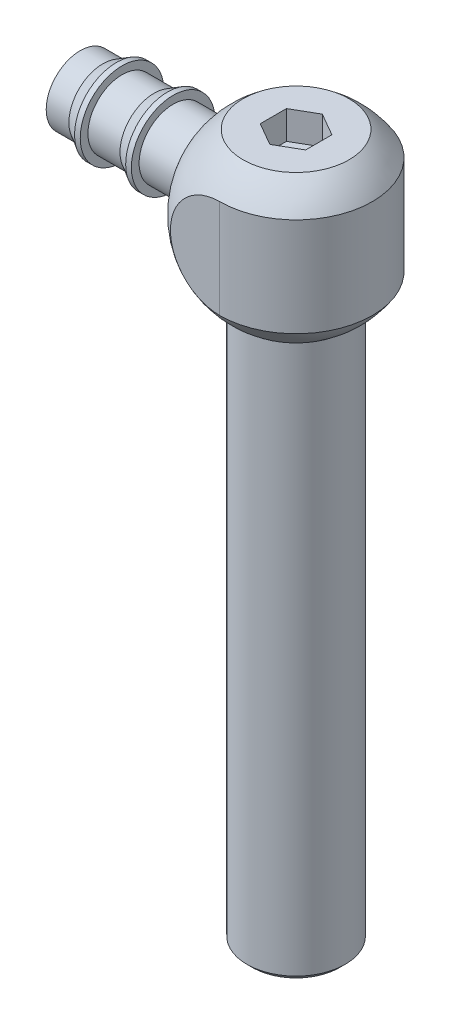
ISO-10303-21;
HEADER;
FILE_DESCRIPTION(('STEP AP214'),'2;1');
FILE_NAME('part.step','',(''),(''),'','','');
FILE_SCHEMA(('AUTOMOTIVE_DESIGN { 1 0 10303 214 1 1 1 1 }'));
ENDSEC;
DATA;
#1=APPLICATION_CONTEXT('core data for automotive mechanical design processes');
#2=APPLICATION_PROTOCOL_DEFINITION('international standard','automotive_design',2000,#1);
#3=PRODUCT_CONTEXT('',#1,'mechanical');
#4=PRODUCT('Part','Part','',(#3));
#5=PRODUCT_RELATED_PRODUCT_CATEGORY('part','',(#4));
#6=PRODUCT_DEFINITION_FORMATION('','',#4);
#7=PRODUCT_DEFINITION_CONTEXT('part definition',#1,'design');
#8=PRODUCT_DEFINITION('design','',#6,#7);
#9=PRODUCT_DEFINITION_SHAPE('','',#8);
#10=(LENGTH_UNIT() NAMED_UNIT(*) SI_UNIT(.MILLI.,.METRE.));
#11=(NAMED_UNIT(*) PLANE_ANGLE_UNIT() SI_UNIT($,.RADIAN.));
#12=(NAMED_UNIT(*) SI_UNIT($,.STERADIAN.) SOLID_ANGLE_UNIT());
#13=UNCERTAINTY_MEASURE_WITH_UNIT(LENGTH_MEASURE(1.E-05),#10,'distance_accuracy_value','');
#14=(GEOMETRIC_REPRESENTATION_CONTEXT(3) GLOBAL_UNCERTAINTY_ASSIGNED_CONTEXT((#13)) GLOBAL_UNIT_ASSIGNED_CONTEXT((#10,
#11,#12)) REPRESENTATION_CONTEXT('',''));
#15=CARTESIAN_POINT('',(0.,0.,0.));
#16=DIRECTION('',(0.,0.,1.));
#17=DIRECTION('',(1.,0.,0.));
#18=AXIS2_PLACEMENT_3D('',#15,#16,#17);
#19=CARTESIAN_POINT('',(-19.05,5.6642,-10.668));
#20=DIRECTION('',(0.,-1.,0.));
#21=DIRECTION('',(1.,0.,0.));
#22=AXIS2_PLACEMENT_3D('',#19,#20,#21);
#23=PLANE('',#22);
#24=CARTESIAN_POINT('',(0.,5.6642,0.));
#25=DIRECTION('',(0.,-1.,0.));
#26=DIRECTION('',(1.,0.,0.));
#27=AXIS2_PLACEMENT_3D('',#24,#25,#26);
#28=CIRCLE('',#27,7.40360712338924);
#29=CARTESIAN_POINT('',(7.40360712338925,5.6642,0.));
#30=VERTEX_POINT('',#29);
#31=EDGE_CURVE('E206',#30,#30,#28,.F.);
#32=ORIENTED_EDGE('',*,*,#31,.F.);
#33=EDGE_LOOP('',(#32));
#34=FACE_BOUND('',#33,.T.);
#35=CARTESIAN_POINT('',(0.,5.6642,0.));
#36=DIRECTION('',(0.,1.,0.));
#37=DIRECTION('',(-1.,0.,0.));
#38=AXIS2_PLACEMENT_3D('',#35,#36,#37);
#39=CIRCLE('',#38,6.85799999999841);
#40=CARTESIAN_POINT('',(-6.85799999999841,5.6642,0.));
#41=VERTEX_POINT('',#40);
#42=EDGE_CURVE('E160',#41,#41,#39,.T.);
#43=ORIENTED_EDGE('',*,*,#42,.T.);
#44=EDGE_LOOP('',(#43));
#45=FACE_BOUND('',#44,.T.);
#46=ADVANCED_FACE('F38',(#34,#45),#23,.T.);
#47=CARTESIAN_POINT('',(-10.668,3.28295,10.668));
#48=DIRECTION('',(1.,0.,0.));
#49=DIRECTION('',(0.,0.,-1.));
#50=AXIS2_PLACEMENT_3D('',#47,#48,#49);
#51=PLANE('',#50);
#52=CARTESIAN_POINT('',(-10.668,15.98295,0.));
#53=DIRECTION('',(1.,0.,0.));
#54=DIRECTION('',(0.,0.,-1.));
#55=AXIS2_PLACEMENT_3D('',#52,#53,#54);
#56=CIRCLE('',#55,5.953125);
#57=CARTESIAN_POINT('',(-10.668,15.98295,-5.953125));
#58=VERTEX_POINT('',#57);
#59=EDGE_CURVE('E12',#58,#58,#56,.T.);
#60=ORIENTED_EDGE('',*,*,#59,.T.);
#61=EDGE_LOOP('',(#60));
#62=FACE_BOUND('',#61,.T.);
#63=CARTESIAN_POINT('',(-10.668,15.98295,0.));
#64=DIRECTION('',(1.,0.,0.));
#65=DIRECTION('',(0.,0.,-1.));
#66=AXIS2_PLACEMENT_3D('',#63,#64,#65);
#67=CIRCLE('',#66,6.89084726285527);
#68=CARTESIAN_POINT('',(-10.668,15.98295,-6.89084726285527));
#69=VERTEX_POINT('',#68);
#70=EDGE_CURVE('E214',#69,#69,#67,.F.);
#71=ORIENTED_EDGE('',*,*,#70,.T.);
#72=EDGE_LOOP('',(#71));
#73=FACE_BOUND('',#72,.T.);
#74=ADVANCED_FACE('F250',(#62,#73),#51,.F.);
#75=CARTESIAN_POINT('',(0.,15.98295,0.));
#76=DIRECTION('',(0.,-1.,0.));
#77=DIRECTION('',(1.,0.,0.));
#78=AXIS2_PLACEMENT_3D('',#75,#76,#77);
#79=SPHERICAL_SURFACE('',#78,12.7);
#80=ORIENTED_EDGE('',*,*,#31,.T.);
#81=EDGE_LOOP('',(#80));
#82=FACE_BOUND('',#81,.T.);
#83=ORIENTED_EDGE('',*,*,#70,.F.);
#84=EDGE_LOOP('',(#83));
#85=FACE_BOUND('',#84,.T.);
#86=CARTESIAN_POINT('',(0.,15.98295,-10.668));
#87=DIRECTION('',(0.,0.,1.));
#88=DIRECTION('',(1.,0.,0.));
#89=AXIS2_PLACEMENT_3D('',#86,#87,#88);
#90=CIRCLE('',#89,6.89084726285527);
#91=CARTESIAN_POINT('',(0.,9.09210273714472,-10.668));
#92=VERTEX_POINT('',#91);
#93=CARTESIAN_POINT('',(0.,22.8737972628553,-10.668));
#94=VERTEX_POINT('',#93);
#95=EDGE_CURVE('E222',#92,#94,#90,.F.);
#96=ORIENTED_EDGE('',*,*,#95,.F.);
#97=CARTESIAN_POINT('',(0.,9.09210273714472,0.));
#98=DIRECTION('',(0.,1.,0.));
#99=DIRECTION('',(0.,0.,1.));
#100=AXIS2_PLACEMENT_3D('',#97,#98,#99);
#101=CIRCLE('',#100,10.668);
#102=CARTESIAN_POINT('',(0.,9.09210273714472,10.668));
#103=VERTEX_POINT('',#102);
#104=EDGE_CURVE('E220',#103,#92,#101,.T.);
#105=ORIENTED_EDGE('',*,*,#104,.F.);
#106=CARTESIAN_POINT('',(0.,15.98295,10.668));
#107=DIRECTION('',(0.,0.,-1.));
#108=DIRECTION('',(-1.,0.,0.));
#109=AXIS2_PLACEMENT_3D('',#106,#107,#108);
#110=CIRCLE('',#109,6.89084726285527);
#111=CARTESIAN_POINT('',(0.,22.8737972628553,10.668));
#112=VERTEX_POINT('',#111);
#113=EDGE_CURVE('E215',#112,#103,#110,.F.);
#114=ORIENTED_EDGE('',*,*,#113,.F.);
#115=CARTESIAN_POINT('',(0.,22.8737972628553,0.));
#116=DIRECTION('',(0.,-1.,0.));
#117=DIRECTION('',(0.,0.,-1.));
#118=AXIS2_PLACEMENT_3D('',#115,#116,#117);
#119=CIRCLE('',#118,10.668);
#120=EDGE_CURVE('E217',#94,#112,#119,.T.);
#121=ORIENTED_EDGE('',*,*,#120,.F.);
#122=EDGE_LOOP('',(#96,#105,#114,#121));
#123=FACE_BOUND('',#122,.T.);
#124=CARTESIAN_POINT('',(0.,26.3017,0.));
#125=DIRECTION('',(0.,1.,0.));
#126=DIRECTION('',(-1.,0.,0.));
#127=AXIS2_PLACEMENT_3D('',#124,#125,#126);
#128=CIRCLE('',#127,7.40360712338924);
#129=CARTESIAN_POINT('',(-7.40360712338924,26.3017,0.));
#130=VERTEX_POINT('',#129);
#131=EDGE_CURVE('E211',#130,#130,#128,.F.);
#132=ORIENTED_EDGE('',*,*,#131,.T.);
#133=EDGE_LOOP('',(#132));
#134=FACE_BOUND('',#133,.T.);
#135=ADVANCED_FACE('F256',(#82,#85,#123,#134),#79,.T.);
#136=CARTESIAN_POINT('',(0.,3.28295,-10.668));
#137=DIRECTION('',(0.,0.,1.));
#138=DIRECTION('',(1.,0.,0.));
#139=AXIS2_PLACEMENT_3D('',#136,#137,#138);
#140=PLANE('',#139);
#141=ORIENTED_EDGE('',*,*,#95,.T.);
#142=DIRECTION('',(0.,-1.,0.));
#143=VECTOR('',#142,1.);
#144=CARTESIAN_POINT('',(0.,3.28295,-10.668));
#145=LINE('',#144,#143);
#146=EDGE_CURVE('E210',#94,#92,#145,.T.);
#147=ORIENTED_EDGE('',*,*,#146,.T.);
#148=EDGE_LOOP('',(#141,#147));
#149=FACE_BOUND('',#148,.T.);
#150=ADVANCED_FACE('F268',(#149),#140,.F.);
#151=CARTESIAN_POINT('',(0.,3.28295,10.668));
#152=DIRECTION('',(0.,0.,-1.));
#153=DIRECTION('',(-1.,0.,0.));
#154=AXIS2_PLACEMENT_3D('',#151,#152,#153);
#155=PLANE('',#154);
#156=ORIENTED_EDGE('',*,*,#113,.T.);
#157=DIRECTION('',(0.,-1.,0.));
#158=VECTOR('',#157,1.);
#159=CARTESIAN_POINT('',(0.,3.28295,10.668));
#160=LINE('',#159,#158);
#161=EDGE_CURVE('E207',#112,#103,#160,.T.);
#162=ORIENTED_EDGE('',*,*,#161,.F.);
#163=EDGE_LOOP('',(#156,#162));
#164=FACE_BOUND('',#163,.T.);
#165=ADVANCED_FACE('F265',(#164),#155,.F.);
#166=CARTESIAN_POINT('',(0.,3.28295,0.));
#167=DIRECTION('',(0.,-1.,0.));
#168=DIRECTION('',(0.,0.,-1.));
#169=AXIS2_PLACEMENT_3D('',#166,#167,#168);
#170=CYLINDRICAL_SURFACE('',#169,10.668);
#171=ORIENTED_EDGE('',*,*,#104,.T.);
#172=ORIENTED_EDGE('',*,*,#146,.F.);
#173=ORIENTED_EDGE('',*,*,#120,.T.);
#174=ORIENTED_EDGE('',*,*,#161,.T.);
#175=EDGE_LOOP('',(#171,#172,#173,#174));
#176=FACE_BOUND('',#175,.T.);
#177=ADVANCED_FACE('F267',(#176),#170,.T.);
#178=CARTESIAN_POINT('',(-19.05,26.3017,-10.668));
#179=DIRECTION('',(0.,1.,0.));
#180=DIRECTION('',(-1.,0.,0.));
#181=AXIS2_PLACEMENT_3D('',#178,#179,#180);
#182=PLANE('',#181);
#183=DIRECTION('',(0.,0.,-1.));
#184=VECTOR('',#183,1.);
#185=CARTESIAN_POINT('',(3.175,26.3017,1.83308710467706));
#186=LINE('',#185,#184);
#187=CARTESIAN_POINT('',(3.175,26.3017,1.83308710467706));
#188=VERTEX_POINT('',#187);
#189=CARTESIAN_POINT('',(3.175,26.3017,-1.83308710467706));
#190=VERTEX_POINT('',#189);
#191=EDGE_CURVE('E59',#188,#190,#186,.T.);
#192=ORIENTED_EDGE('',*,*,#191,.F.);
#193=DIRECTION('',(0.866025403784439,0.,-0.5));
#194=VECTOR('',#193,1.);
#195=CARTESIAN_POINT('',(0.,26.3017,3.66617420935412));
#196=LINE('',#195,#194);
#197=CARTESIAN_POINT('',(0.,26.3017,3.66617420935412));
#198=VERTEX_POINT('',#197);
#199=EDGE_CURVE('E127',#198,#188,#196,.T.);
#200=ORIENTED_EDGE('',*,*,#199,.F.);
#201=DIRECTION('',(0.866025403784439,0.,0.5));
#202=VECTOR('',#201,1.);
#203=CARTESIAN_POINT('',(-3.17499999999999,26.3017,1.83308710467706));
#204=LINE('',#203,#202);
#205=CARTESIAN_POINT('',(-3.17499999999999,26.3017,1.83308710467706));
#206=VERTEX_POINT('',#205);
#207=EDGE_CURVE('E130',#206,#198,#204,.T.);
#208=ORIENTED_EDGE('',*,*,#207,.F.);
#209=DIRECTION('',(0.,0.,1.));
#210=VECTOR('',#209,1.);
#211=CARTESIAN_POINT('',(-3.17499999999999,26.3017,-1.83308710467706));
#212=LINE('',#211,#210);
#213=CARTESIAN_POINT('',(-3.17499999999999,26.3017,-1.83308710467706));
#214=VERTEX_POINT('',#213);
#215=EDGE_CURVE('E153',#214,#206,#212,.T.);
#216=ORIENTED_EDGE('',*,*,#215,.F.);
#217=DIRECTION('',(-0.866025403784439,0.,0.5));
#218=VECTOR('',#217,1.);
#219=CARTESIAN_POINT('',(0.,26.3017,-3.66617420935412));
#220=LINE('',#219,#218);
#221=CARTESIAN_POINT('',(0.,26.3017,-3.66617420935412));
#222=VERTEX_POINT('',#221);
#223=EDGE_CURVE('E150',#222,#214,#220,.T.);
#224=ORIENTED_EDGE('',*,*,#223,.F.);
#225=DIRECTION('',(-0.866025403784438,0.,-0.5));
#226=VECTOR('',#225,1.);
#227=CARTESIAN_POINT('',(3.175,26.3017,-1.83308710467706));
#228=LINE('',#227,#226);
#229=EDGE_CURVE('E148',#190,#222,#228,.T.);
#230=ORIENTED_EDGE('',*,*,#229,.F.);
#231=EDGE_LOOP('',(#192,#200,#208,#216,#224,#230));
#232=FACE_BOUND('',#231,.T.);
#233=ORIENTED_EDGE('',*,*,#131,.F.);
#234=EDGE_LOOP('',(#233));
#235=FACE_BOUND('',#234,.T.);
#236=ADVANCED_FACE('F263',(#232,#235),#182,.T.);
#237=CARTESIAN_POINT('',(0.,15.98295,0.));
#238=DIRECTION('',(-1.,0.,0.));
#239=DIRECTION('',(0.,0.,1.));
#240=AXIS2_PLACEMENT_3D('',#237,#238,#239);
#241=CYLINDRICAL_SURFACE('',#240,4.7625);
#242=CARTESIAN_POINT('',(-11.858625,15.98295,0.));
#243=DIRECTION('',(1.,0.,0.));
#244=DIRECTION('',(0.,0.,-1.));
#245=AXIS2_PLACEMENT_3D('',#242,#243,#244);
#246=CIRCLE('',#245,4.7625);
#247=CARTESIAN_POINT('',(-11.858625,15.98295,-4.7625));
#248=VERTEX_POINT('',#247);
#249=EDGE_CURVE('E46',#248,#248,#246,.F.);
#250=ORIENTED_EDGE('',*,*,#249,.T.);
#251=EDGE_LOOP('',(#250));
#252=FACE_BOUND('',#251,.T.);
#253=CARTESIAN_POINT('',(-17.1802511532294,15.98295,0.));
#254=DIRECTION('',(-1.,0.,0.));
#255=DIRECTION('',(0.,0.,1.));
#256=AXIS2_PLACEMENT_3D('',#253,#254,#255);
#257=CIRCLE('',#256,4.7625);
#258=CARTESIAN_POINT('',(-17.1802511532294,15.98295,4.7625));
#259=VERTEX_POINT('',#258);
#260=EDGE_CURVE('E182',#259,#259,#257,.T.);
#261=ORIENTED_EDGE('',*,*,#260,.F.);
#262=EDGE_LOOP('',(#261));
#263=FACE_BOUND('',#262,.T.);
#264=ADVANCED_FACE('F232',(#252,#263),#241,.T.);
#265=CARTESIAN_POINT('',(0.,15.98295,0.));
#266=DIRECTION('',(-1.,0.,0.));
#267=DIRECTION('',(0.,0.,1.));
#268=AXIS2_PLACEMENT_3D('',#265,#266,#267);
#269=CYLINDRICAL_SURFACE('',#268,4.7625);
#270=CARTESIAN_POINT('',(-30.1625,15.98295,0.));
#271=DIRECTION('',(-1.,0.,0.));
#272=DIRECTION('',(0.,0.,1.));
#273=AXIS2_PLACEMENT_3D('',#270,#271,#272);
#274=CIRCLE('',#273,4.7625);
#275=CARTESIAN_POINT('',(-30.1625,15.98295,4.7625));
#276=VERTEX_POINT('',#275);
#277=EDGE_CURVE('E179',#276,#276,#274,.T.);
#278=ORIENTED_EDGE('',*,*,#277,.F.);
#279=EDGE_LOOP('',(#278));
#280=FACE_BOUND('',#279,.T.);
#281=CARTESIAN_POINT('',(-26.9875,15.98295,0.));
#282=DIRECTION('',(-1.,0.,0.));
#283=DIRECTION('',(0.,0.,1.));
#284=AXIS2_PLACEMENT_3D('',#281,#282,#283);
#285=CIRCLE('',#284,4.7625);
#286=CARTESIAN_POINT('',(-26.9875,15.98295,4.7625));
#287=VERTEX_POINT('',#286);
#288=EDGE_CURVE('E203',#287,#287,#285,.T.);
#289=ORIENTED_EDGE('',*,*,#288,.T.);
#290=EDGE_LOOP('',(#289));
#291=FACE_BOUND('',#290,.T.);
#292=ADVANCED_FACE('F294',(#280,#291),#269,.T.);
#293=CARTESIAN_POINT('',(-25.1177511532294,15.98295,0.));
#294=DIRECTION('',(1.,0.,0.));
#295=DIRECTION('',(0.,0.,-1.));
#296=AXIS2_PLACEMENT_3D('',#293,#294,#295);
#297=CONICAL_SURFACE('',#296,5.842,0.523598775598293);
#298=ORIENTED_EDGE('',*,*,#288,.F.);
#299=EDGE_LOOP('',(#298));
#300=FACE_BOUND('',#299,.T.);
#301=CARTESIAN_POINT('',(-25.1177511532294,15.98295,0.));
#302=DIRECTION('',(-1.,0.,0.));
#303=DIRECTION('',(0.,0.,1.));
#304=AXIS2_PLACEMENT_3D('',#301,#302,#303);
#305=CIRCLE('',#304,5.842);
#306=CARTESIAN_POINT('',(-25.1177511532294,15.98295,5.842));
#307=VERTEX_POINT('',#306);
#308=EDGE_CURVE('E200',#307,#307,#305,.T.);
#309=ORIENTED_EDGE('',*,*,#308,.T.);
#310=EDGE_LOOP('',(#309));
#311=FACE_BOUND('',#310,.T.);
#312=ADVANCED_FACE('F360',(#300,#311),#297,.T.);
#313=CARTESIAN_POINT('',(0.,15.98295,0.));
#314=DIRECTION('',(-1.,0.,0.));
#315=DIRECTION('',(0.,0.,1.));
#316=AXIS2_PLACEMENT_3D('',#313,#314,#315);
#317=CYLINDRICAL_SURFACE('',#316,5.842);
#318=ORIENTED_EDGE('',*,*,#308,.F.);
#319=EDGE_LOOP('',(#318));
#320=FACE_BOUND('',#319,.T.);
#321=CARTESIAN_POINT('',(-24.3240011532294,15.98295,0.));
#322=DIRECTION('',(-1.,0.,0.));
#323=DIRECTION('',(0.,0.,1.));
#324=AXIS2_PLACEMENT_3D('',#321,#322,#323);
#325=CIRCLE('',#324,5.842);
#326=CARTESIAN_POINT('',(-24.3240011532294,15.98295,5.842));
#327=VERTEX_POINT('',#326);
#328=EDGE_CURVE('E197',#327,#327,#325,.T.);
#329=ORIENTED_EDGE('',*,*,#328,.T.);
#330=EDGE_LOOP('',(#329));
#331=FACE_BOUND('',#330,.T.);
#332=ADVANCED_FACE('F356',(#320,#331),#317,.T.);
#333=CARTESIAN_POINT('',(-24.3240011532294,15.98295,-5.842));
#334=DIRECTION('',(-1.,0.,0.));
#335=DIRECTION('',(0.,0.,1.));
#336=AXIS2_PLACEMENT_3D('',#333,#334,#335);
#337=PLANE('',#336);
#338=ORIENTED_EDGE('',*,*,#328,.F.);
#339=EDGE_LOOP('',(#338));
#340=FACE_BOUND('',#339,.T.);
#341=CARTESIAN_POINT('',(-24.3240011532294,15.98295,0.));
#342=DIRECTION('',(-1.,0.,0.));
#343=DIRECTION('',(0.,0.,1.));
#344=AXIS2_PLACEMENT_3D('',#341,#342,#343);
#345=CIRCLE('',#344,4.7625);
#346=CARTESIAN_POINT('',(-24.3240011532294,15.98295,4.7625));
#347=VERTEX_POINT('',#346);
#348=EDGE_CURVE('E194',#347,#347,#345,.T.);
#349=ORIENTED_EDGE('',*,*,#348,.T.);
#350=EDGE_LOOP('',(#349));
#351=FACE_BOUND('',#350,.T.);
#352=ADVANCED_FACE('F352',(#340,#351),#337,.F.);
#353=CARTESIAN_POINT('',(0.,15.98295,0.));
#354=DIRECTION('',(-1.,0.,0.));
#355=DIRECTION('',(0.,0.,1.));
#356=AXIS2_PLACEMENT_3D('',#353,#354,#355);
#357=CYLINDRICAL_SURFACE('',#356,4.7625);
#358=ORIENTED_EDGE('',*,*,#348,.F.);
#359=EDGE_LOOP('',(#358));
#360=FACE_BOUND('',#359,.T.);
#361=CARTESIAN_POINT('',(-19.84375,15.98295,0.));
#362=DIRECTION('',(-1.,0.,0.));
#363=DIRECTION('',(0.,0.,1.));
#364=AXIS2_PLACEMENT_3D('',#361,#362,#363);
#365=CIRCLE('',#364,4.7625);
#366=CARTESIAN_POINT('',(-19.84375,15.98295,4.7625));
#367=VERTEX_POINT('',#366);
#368=EDGE_CURVE('E191',#367,#367,#365,.T.);
#369=ORIENTED_EDGE('',*,*,#368,.T.);
#370=EDGE_LOOP('',(#369));
#371=FACE_BOUND('',#370,.T.);
#372=ADVANCED_FACE('F348',(#360,#371),#357,.T.);
#373=CARTESIAN_POINT('',(-17.9740011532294,15.98295,0.));
#374=DIRECTION('',(1.,0.,0.));
#375=DIRECTION('',(0.,0.,-1.));
#376=AXIS2_PLACEMENT_3D('',#373,#374,#375);
#377=CONICAL_SURFACE('',#376,5.842,0.523598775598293);
#378=ORIENTED_EDGE('',*,*,#368,.F.);
#379=EDGE_LOOP('',(#378));
#380=FACE_BOUND('',#379,.T.);
#381=CARTESIAN_POINT('',(-17.9740011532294,15.98295,0.));
#382=DIRECTION('',(-1.,0.,0.));
#383=DIRECTION('',(0.,0.,1.));
#384=AXIS2_PLACEMENT_3D('',#381,#382,#383);
#385=CIRCLE('',#384,5.842);
#386=CARTESIAN_POINT('',(-17.9740011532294,15.98295,5.842));
#387=VERTEX_POINT('',#386);
#388=EDGE_CURVE('E188',#387,#387,#385,.T.);
#389=ORIENTED_EDGE('',*,*,#388,.T.);
#390=EDGE_LOOP('',(#389));
#391=FACE_BOUND('',#390,.T.);
#392=ADVANCED_FACE('F344',(#380,#391),#377,.T.);
#393=CARTESIAN_POINT('',(0.,15.98295,0.));
#394=DIRECTION('',(-1.,0.,0.));
#395=DIRECTION('',(0.,0.,1.));
#396=AXIS2_PLACEMENT_3D('',#393,#394,#395);
#397=CYLINDRICAL_SURFACE('',#396,5.842);
#398=ORIENTED_EDGE('',*,*,#388,.F.);
#399=EDGE_LOOP('',(#398));
#400=FACE_BOUND('',#399,.T.);
#401=CARTESIAN_POINT('',(-17.1802511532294,15.98295,0.));
#402=DIRECTION('',(-1.,0.,0.));
#403=DIRECTION('',(0.,0.,1.));
#404=AXIS2_PLACEMENT_3D('',#401,#402,#403);
#405=CIRCLE('',#404,5.842);
#406=CARTESIAN_POINT('',(-17.1802511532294,15.98295,5.842));
#407=VERTEX_POINT('',#406);
#408=EDGE_CURVE('E185',#407,#407,#405,.T.);
#409=ORIENTED_EDGE('',*,*,#408,.T.);
#410=EDGE_LOOP('',(#409));
#411=FACE_BOUND('',#410,.T.);
#412=ADVANCED_FACE('F340',(#400,#411),#397,.T.);
#413=CARTESIAN_POINT('',(-17.1802511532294,15.98295,-5.842));
#414=DIRECTION('',(-1.,0.,0.));
#415=DIRECTION('',(0.,0.,1.));
#416=AXIS2_PLACEMENT_3D('',#413,#414,#415);
#417=PLANE('',#416);
#418=ORIENTED_EDGE('',*,*,#408,.F.);
#419=EDGE_LOOP('',(#418));
#420=FACE_BOUND('',#419,.T.);
#421=ORIENTED_EDGE('',*,*,#260,.T.);
#422=EDGE_LOOP('',(#421));
#423=FACE_BOUND('',#422,.T.);
#424=ADVANCED_FACE('F245',(#420,#423),#417,.F.);
#425=CARTESIAN_POINT('',(-30.1625,15.98295,0.));
#426=DIRECTION('',(1.,0.,0.));
#427=DIRECTION('',(0.,0.,-1.));
#428=AXIS2_PLACEMENT_3D('',#425,#426,#427);
#429=PLANE('',#428);
#430=CARTESIAN_POINT('',(-30.1625,15.98295,0.));
#431=DIRECTION('',(-1.,0.,0.));
#432=DIRECTION('',(0.,0.,1.));
#433=AXIS2_PLACEMENT_3D('',#430,#431,#432);
#434=CIRCLE('',#433,3.4925);
#435=CARTESIAN_POINT('',(-30.1625,15.98295,3.4925));
#436=VERTEX_POINT('',#435);
#437=EDGE_CURVE('E176',#436,#436,#434,.T.);
#438=ORIENTED_EDGE('',*,*,#437,.F.);
#439=EDGE_LOOP('',(#438));
#440=FACE_BOUND('',#439,.T.);
#441=ORIENTED_EDGE('',*,*,#277,.T.);
#442=EDGE_LOOP('',(#441));
#443=FACE_BOUND('',#442,.T.);
#444=ADVANCED_FACE('F237',(#440,#443),#429,.F.);
#445=CARTESIAN_POINT('',(-11.858625,15.98295,0.));
#446=DIRECTION('',(1.,0.,0.));
#447=DIRECTION('',(0.,0.,-1.));
#448=AXIS2_PLACEMENT_3D('',#445,#446,#447);
#449=TOROIDAL_SURFACE('',#448,5.953125,1.190625);
#450=ORIENTED_EDGE('',*,*,#59,.F.);
#451=EDGE_LOOP('',(#450));
#452=FACE_BOUND('',#451,.T.);
#453=ORIENTED_EDGE('',*,*,#249,.F.);
#454=EDGE_LOOP('',(#453));
#455=FACE_BOUND('',#454,.T.);
#456=ADVANCED_FACE('F40',(#452,#455),#449,.F.);
#457=CARTESIAN_POINT('',(9.87828173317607,15.98295,0.));
#458=DIRECTION('',(-1.,0.,0.));
#459=DIRECTION('',(0.,0.,1.));
#460=AXIS2_PLACEMENT_3D('',#457,#458,#459);
#461=CYLINDRICAL_SURFACE('',#460,3.4925);
#462=CARTESIAN_POINT('',(-3.23787739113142,15.98295,3.4925));
#463=CARTESIAN_POINT('',(-3.23787574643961,15.9006540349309,3.49250095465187));
#464=CARTESIAN_POINT('',(-3.24103033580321,15.8183648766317,3.4895846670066));
#465=CARTESIAN_POINT('',(-3.25345666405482,15.6546240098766,3.47800197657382));
#466=CARTESIAN_POINT('',(-3.26273142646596,15.573172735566,3.46933273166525));
#467=CARTESIAN_POINT('',(-3.28690649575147,15.4117293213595,3.4464367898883));
#468=CARTESIAN_POINT('',(-3.30181917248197,15.3317407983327,3.43219787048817));
#469=CARTESIAN_POINT('',(-3.33652658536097,15.1739419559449,3.39846758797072));
#470=CARTESIAN_POINT('',(-3.35632424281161,15.0961329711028,3.37897308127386));
#471=CARTESIAN_POINT('',(-3.42118356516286,14.8686944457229,3.31370243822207));
#472=CARTESIAN_POINT('',(-3.47210346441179,14.7227311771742,3.26079327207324));
#473=CARTESIAN_POINT('',(-3.58341103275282,14.4422966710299,3.13806132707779));
#474=CARTESIAN_POINT('',(-3.64379804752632,14.3078246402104,3.06823971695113));
#475=CARTESIAN_POINT('',(-3.78139961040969,14.0250801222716,2.89770102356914));
#476=CARTESIAN_POINT('',(-3.85958419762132,13.8793156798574,2.79360655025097));
#477=CARTESIAN_POINT('',(-4.01569902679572,13.6049902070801,2.56414850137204));
#478=CARTESIAN_POINT('',(-4.09362876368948,13.4764533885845,2.43875554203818));
#479=CARTESIAN_POINT('',(-4.21312256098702,13.2867402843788,2.22250847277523));
#480=CARTESIAN_POINT('',(-4.25666537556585,13.2193208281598,2.13815073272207));
#481=CARTESIAN_POINT('',(-4.34045231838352,13.0919321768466,1.96248243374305));
#482=CARTESIAN_POINT('',(-4.38069795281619,13.0319595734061,1.87117508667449));
#483=CARTESIAN_POINT('',(-4.45672144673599,12.9202409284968,1.68208305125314));
#484=CARTESIAN_POINT('',(-4.49250579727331,12.8684829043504,1.58430809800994));
#485=CARTESIAN_POINT('',(-4.55856277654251,12.7739336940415,1.38280879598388));
#486=CARTESIAN_POINT('',(-4.58883813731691,12.7311380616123,1.27908742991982));
#487=CARTESIAN_POINT('',(-4.65414554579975,12.6394999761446,1.02198440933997));
#488=CARTESIAN_POINT('',(-4.68589117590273,12.5955855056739,0.86594013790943));
#489=CARTESIAN_POINT('',(-4.7337194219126,12.5297250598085,0.547057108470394));
#490=CARTESIAN_POINT('',(-4.7498153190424,12.5077604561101,0.384224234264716));
#491=CARTESIAN_POINT('',(-4.76501199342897,12.4870177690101,0.0558737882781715));
#492=CARTESIAN_POINT('',(-4.76407247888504,12.4882946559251,-0.109649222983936));
#493=CARTESIAN_POINT('',(-4.7451770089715,12.5140986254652,-0.437889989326));
#494=CARTESIAN_POINT('',(-4.72721678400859,12.5386315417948,-0.600607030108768));
#495=CARTESIAN_POINT('',(-4.67663048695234,12.6084016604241,-0.913758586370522));
#496=CARTESIAN_POINT('',(-4.64446581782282,12.652988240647,-1.06441595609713));
#497=CARTESIAN_POINT('',(-4.56796317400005,12.760549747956,-1.35566195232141));
#498=CARTESIAN_POINT('',(-4.52362267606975,12.8235284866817,-1.49624848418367));
#499=CARTESIAN_POINT('',(-4.42013192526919,12.9734671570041,-1.78020188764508));
#500=CARTESIAN_POINT('',(-4.35988897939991,13.0623032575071,-1.92217271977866));
#501=CARTESIAN_POINT('',(-4.23176072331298,13.2572665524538,-2.18990467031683));
#502=CARTESIAN_POINT('',(-4.16386826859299,13.3634099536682,-2.31565039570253));
#503=CARTESIAN_POINT('',(-4.01118991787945,13.6128511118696,-2.57257203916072));
#504=CARTESIAN_POINT('',(-3.92565795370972,13.7593716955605,-2.70017994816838));
#505=CARTESIAN_POINT('',(-3.75713602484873,14.0725322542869,-2.93012214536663));
#506=CARTESIAN_POINT('',(-3.67414665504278,14.2391768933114,-3.03245055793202));
#507=CARTESIAN_POINT('',(-3.53685230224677,14.5542998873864,-3.19070979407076));
#508=CARTESIAN_POINT('',(-3.48019979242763,14.6991102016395,-3.25187952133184));
#509=CARTESIAN_POINT('',(-3.38087443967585,14.9998667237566,-3.35503240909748));
#510=CARTESIAN_POINT('',(-3.33817016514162,15.155786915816,-3.39705879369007));
#511=CARTESIAN_POINT('',(-3.27911773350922,15.448551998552,-3.45401224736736));
#512=CARTESIAN_POINT('',(-3.25949455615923,15.5840498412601,-3.47236265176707));
#513=CARTESIAN_POINT('',(-3.23744512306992,15.8576123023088,-3.49293703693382));
#514=CARTESIAN_POINT('',(-3.23500237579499,15.9956743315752,-3.49517648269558));
#515=CARTESIAN_POINT('',(-3.24769267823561,16.2701175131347,-3.48338281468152));
#516=CARTESIAN_POINT('',(-3.26281055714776,16.4065000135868,-3.46936374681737));
#517=CARTESIAN_POINT('',(-3.30821474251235,16.6742873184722,-3.42608775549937));
#518=CARTESIAN_POINT('',(-3.33852508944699,16.8056838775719,-3.39680667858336));
#519=CARTESIAN_POINT('',(-3.42483095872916,17.1121389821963,-3.31013169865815));
#520=CARTESIAN_POINT('',(-3.48624709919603,17.2837922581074,-3.24618958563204));
#521=CARTESIAN_POINT('',(-3.62119007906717,17.611316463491,-3.09494294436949));
#522=CARTESIAN_POINT('',(-3.69474120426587,17.7671547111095,-3.0075913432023));
#523=CARTESIAN_POINT('',(-3.84843797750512,18.0670995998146,-2.8084287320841));
#524=CARTESIAN_POINT('',(-3.92871853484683,18.2106802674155,-2.69593234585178));
#525=CARTESIAN_POINT('',(-4.08698884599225,18.4792185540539,-2.44936261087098));
#526=CARTESIAN_POINT('',(-4.16498031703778,18.6041904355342,-2.31530595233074));
#527=CARTESIAN_POINT('',(-4.31101468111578,18.8304477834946,-2.03016864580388));
#528=CARTESIAN_POINT('',(-4.37926095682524,18.9322571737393,-1.87961091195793));
#529=CARTESIAN_POINT('',(-4.50292722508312,19.1129410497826,-1.56020858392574));
#530=CARTESIAN_POINT('',(-4.55835000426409,19.1918205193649,-1.39136797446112));
#531=CARTESIAN_POINT('',(-4.62829990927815,19.2901892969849,-1.12639066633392));
#532=CARTESIAN_POINT('',(-4.64949140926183,19.319750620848,-1.03562899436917));
#533=CARTESIAN_POINT('',(-4.68678858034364,19.3715284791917,-0.851034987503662));
#534=CARTESIAN_POINT('',(-4.70289700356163,19.3937489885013,-0.757204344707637));
#535=CARTESIAN_POINT('',(-4.72955915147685,19.4304182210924,-0.567331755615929));
#536=CARTESIAN_POINT('',(-4.74011687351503,19.4448725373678,-0.471291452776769));
#537=CARTESIAN_POINT('',(-4.75537474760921,19.4657348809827,-0.277884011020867));
#538=CARTESIAN_POINT('',(-4.76007592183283,19.4721443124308,-0.180517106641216));
#539=CARTESIAN_POINT('',(-4.76322226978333,19.4764349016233,-0.00011471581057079));
#540=CARTESIAN_POINT('',(-4.76249924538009,19.4754499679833,0.0828822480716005));
#541=CARTESIAN_POINT('',(-4.75673542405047,19.4675861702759,0.248473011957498));
#542=CARTESIAN_POINT('',(-4.75169331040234,19.4607055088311,0.331066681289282));
#543=CARTESIAN_POINT('',(-4.73740392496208,19.4411563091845,0.495164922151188));
#544=CARTESIAN_POINT('',(-4.72815830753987,19.4284900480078,0.576669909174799));
#545=CARTESIAN_POINT('',(-4.70566945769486,19.3975634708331,0.738061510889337));
#546=CARTESIAN_POINT('',(-4.69242466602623,19.3793009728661,0.817947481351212));
#547=CARTESIAN_POINT('',(-4.64796968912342,19.3177037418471,1.04974765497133));
#548=CARTESIAN_POINT('',(-4.6115753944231,19.2669382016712,1.19877819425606));
#549=CARTESIAN_POINT('',(-4.52727870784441,19.1474697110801,1.48580198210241));
#550=CARTESIAN_POINT('',(-4.47937448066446,19.0787638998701,1.6237934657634));
#551=CARTESIAN_POINT('',(-4.36819246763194,18.9157427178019,1.90416795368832));
#552=CARTESIAN_POINT('',(-4.30372862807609,18.8192669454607,2.04482074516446));
#553=CARTESIAN_POINT('',(-4.16805500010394,18.60884120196,2.30885669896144));
#554=CARTESIAN_POINT('',(-4.09683673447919,18.4948691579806,2.4322176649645));
#555=CARTESIAN_POINT('',(-3.93818988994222,18.2277779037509,2.68292029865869));
#556=CARTESIAN_POINT('',(-3.8502835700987,18.0713477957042,2.80644275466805));
#557=CARTESIAN_POINT('',(-3.67995847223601,17.7376167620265,3.02631644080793));
#558=CARTESIAN_POINT('',(-3.59753729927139,17.5603250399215,3.12267958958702));
#559=CARTESIAN_POINT('',(-3.47074274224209,17.2388777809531,3.2621443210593));
#560=CARTESIAN_POINT('',(-3.42220579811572,17.0995666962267,3.31260085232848));
#561=CARTESIAN_POINT('',(-3.33949406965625,16.8118888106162,3.39597870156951));
#562=CARTESIAN_POINT('',(-3.30527509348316,16.6635515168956,3.42895405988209));
#563=CARTESIAN_POINT('',(-3.26683604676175,16.4253931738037,3.46547921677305));
#564=CARTESIAN_POINT('',(-3.25604608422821,16.337586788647,3.47558051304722));
#565=CARTESIAN_POINT('',(-3.24156723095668,16.1608343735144,3.48909077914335));
#566=CARTESIAN_POINT('',(-3.23787916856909,16.0718882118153,3.49249896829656));
#567=CARTESIAN_POINT('',(-3.23787739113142,15.98295,3.4925));
#568=B_SPLINE_CURVE_WITH_KNOTS('',3,(#462,#463,#464,#465,#466,#467,#468,#469,#470,#471,#472,
#473,#474,#475,#476,#477,#478,#479,#480,#481,#482,#483,#484,#485,#486,#487,#488,#489,#490,#491,
#492,#493,#494,#495,#496,#497,#498,#499,#500,#501,#502,#503,#504,#505,#506,#507,#508,#509,#510,
#511,#512,#513,#514,#515,#516,#517,#518,#519,#520,#521,#522,#523,#524,#525,#526,#527,#528,#529,
#530,#531,#532,#533,#534,#535,#536,#537,#538,#539,#540,#541,#542,#543,#544,#545,#546,#547,#548,
#549,#550,#551,#552,#553,#554,#555,#556,#557,#558,#559,#560,#561,#562,#563,#564,#565,#566,#567),
.UNSPECIFIED.,.T.,.F.,(4,2,2,2,2,2,2,2,2,2,2,2,2,2,2,2,2,2,2,2,2,2,2,2,2,2,2,2,2,2,2,2,2,2,2,2,
2,2,2,2,2,2,2,2,2,2,2,2,2,2,2,2,4),(0.,0.246766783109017,0.493655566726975,0.741089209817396,
0.988671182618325,1.47678799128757,1.96487107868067,2.54920623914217,3.13435420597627,
3.48324329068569,3.83197209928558,4.18018744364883,4.52822962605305,5.0214971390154,
5.51434567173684,6.00836003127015,6.50249834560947,6.98164737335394,7.46089577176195,
7.99287476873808,8.52535480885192,9.15976130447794,9.79431511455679,10.2939861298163,
10.7925232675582,11.2050923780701,11.6172654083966,12.0290826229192,12.4415535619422,
13.0179778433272,13.5955700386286,14.1914045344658,14.7867799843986,15.3669326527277,
15.9469591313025,16.2399137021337,16.5327093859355,16.8252939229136,17.1178273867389,
17.3665304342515,17.6153093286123,17.86399039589,18.1127685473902,18.595407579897,
19.0781236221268,19.6231162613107,20.168802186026,20.8197105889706,21.470332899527,
21.9366078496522,22.4014328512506,22.6680854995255,22.9347692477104),.UNSPECIFIED.);
#569=CARTESIAN_POINT('',(-4.7625,19.4754499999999,0.));
#570=VERTEX_POINT('',#569);
#571=EDGE_CURVE('E133',#570,#570,#568,.T.);
#572=ORIENTED_EDGE('',*,*,#571,.T.);
#573=EDGE_LOOP('',(#572));
#574=FACE_BOUND('',#573,.T.);
#575=ORIENTED_EDGE('',*,*,#437,.T.);
#576=EDGE_LOOP('',(#575));
#577=FACE_BOUND('',#576,.T.);
#578=ADVANCED_FACE('F236',(#574,#577),#461,.F.);
#579=CARTESIAN_POINT('',(0.,-72.1233,0.));
#580=DIRECTION('',(0.,1.,0.));
#581=DIRECTION('',(-1.,0.,0.));
#582=AXIS2_PLACEMENT_3D('',#579,#580,#581);
#583=CONICAL_SURFACE('',#582,6.09599999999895,0.785398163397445);
#584=CARTESIAN_POINT('',(0.,-71.3613,0.));
#585=DIRECTION('',(0.,1.,0.));
#586=DIRECTION('',(-1.,0.,0.));
#587=AXIS2_PLACEMENT_3D('',#584,#585,#586);
#588=CIRCLE('',#587,6.85799999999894);
#589=CARTESIAN_POINT('',(-6.85799999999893,-71.3613,0.));
#590=VERTEX_POINT('',#589);
#591=EDGE_CURVE('E173',#590,#590,#588,.T.);
#592=ORIENTED_EDGE('',*,*,#591,.F.);
#593=EDGE_LOOP('',(#592));
#594=FACE_BOUND('',#593,.T.);
#595=CARTESIAN_POINT('',(0.,-72.1233,0.));
#596=DIRECTION('',(0.,1.,0.));
#597=DIRECTION('',(-1.,0.,0.));
#598=AXIS2_PLACEMENT_3D('',#595,#596,#597);
#599=CIRCLE('',#598,6.09599999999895);
#600=CARTESIAN_POINT('',(-6.09599999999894,-72.1233,0.));
#601=VERTEX_POINT('',#600);
#602=EDGE_CURVE('E170',#601,#601,#599,.T.);
#603=ORIENTED_EDGE('',*,*,#602,.T.);
#604=EDGE_LOOP('',(#603));
#605=FACE_BOUND('',#604,.T.);
#606=ADVANCED_FACE('F243',(#594,#605),#583,.T.);
#607=CARTESIAN_POINT('',(0.,-72.1233,0.));
#608=DIRECTION('',(0.,1.,0.));
#609=DIRECTION('',(-1.,0.,0.));
#610=AXIS2_PLACEMENT_3D('',#607,#608,#609);
#611=PLANE('',#610);
#612=CARTESIAN_POINT('',(0.,-72.1233,0.));
#613=DIRECTION('',(0.,-1.,0.));
#614=DIRECTION('',(1.,0.,0.));
#615=AXIS2_PLACEMENT_3D('',#612,#613,#614);
#616=CIRCLE('',#615,4.76249999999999);
#617=CARTESIAN_POINT('',(4.76249999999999,-72.1233,0.));
#618=VERTEX_POINT('',#617);
#619=EDGE_CURVE('E603',#618,#618,#616,.T.);
#620=ORIENTED_EDGE('',*,*,#619,.F.);
#621=EDGE_LOOP('',(#620));
#622=FACE_BOUND('',#621,.T.);
#623=ORIENTED_EDGE('',*,*,#602,.F.);
#624=EDGE_LOOP('',(#623));
#625=FACE_BOUND('',#624,.T.);
#626=ADVANCED_FACE('F329',(#622,#625),#611,.F.);
#627=CARTESIAN_POINT('',(0.,-23.6774565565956,0.));
#628=DIRECTION('',(0.,1.,0.));
#629=DIRECTION('',(-1.,0.,0.));
#630=AXIS2_PLACEMENT_3D('',#627,#628,#629);
#631=CYLINDRICAL_SURFACE('',#630,6.85799999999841);
#632=ORIENTED_EDGE('',*,*,#42,.F.);
#633=EDGE_LOOP('',(#632));
#634=FACE_BOUND('',#633,.T.);
#635=ORIENTED_EDGE('',*,*,#591,.T.);
#636=EDGE_LOOP('',(#635));
#637=FACE_BOUND('',#636,.T.);
#638=ADVANCED_FACE('F317',(#634,#637),#631,.T.);
#639=CARTESIAN_POINT('',(3.175,22.33295,1.83308710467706));
#640=DIRECTION('',(1.,0.,0.));
#641=DIRECTION('',(0.,0.,-1.));
#642=AXIS2_PLACEMENT_3D('',#639,#640,#641);
#643=PLANE('',#642);
#644=ORIENTED_EDGE('',*,*,#191,.T.);
#645=DIRECTION('',(0.,1.,0.));
#646=VECTOR('',#645,1.);
#647=CARTESIAN_POINT('',(3.175,22.33295,-1.83308710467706));
#648=LINE('',#647,#646);
#649=CARTESIAN_POINT('',(3.175,22.33295,-1.83308710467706));
#650=VERTEX_POINT('',#649);
#651=EDGE_CURVE('E104',#650,#190,#648,.T.);
#652=ORIENTED_EDGE('',*,*,#651,.F.);
#653=DIRECTION('',(0.,0.,-1.));
#654=VECTOR('',#653,1.);
#655=CARTESIAN_POINT('',(3.175,22.33295,1.83308710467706));
#656=LINE('',#655,#654);
#657=CARTESIAN_POINT('',(3.175,22.33295,1.83308710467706));
#658=VERTEX_POINT('',#657);
#659=EDGE_CURVE('E108',#658,#650,#656,.T.);
#660=ORIENTED_EDGE('',*,*,#659,.F.);
#661=DIRECTION('',(0.,1.,0.));
#662=VECTOR('',#661,1.);
#663=CARTESIAN_POINT('',(3.175,22.33295,1.83308710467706));
#664=LINE('',#663,#662);
#665=EDGE_CURVE('E158',#658,#188,#664,.T.);
#666=ORIENTED_EDGE('',*,*,#665,.T.);
#667=EDGE_LOOP('',(#644,#652,#660,#666));
#668=FACE_BOUND('',#667,.T.);
#669=ADVANCED_FACE('F106',(#668),#643,.F.);
#670=CARTESIAN_POINT('',(0.,22.33295,3.66617420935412));
#671=DIRECTION('',(0.5,0.,0.866025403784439));
#672=DIRECTION('',(0.866025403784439,0.,-0.5));
#673=AXIS2_PLACEMENT_3D('',#670,#671,#672);
#674=PLANE('',#673);
#675=ORIENTED_EDGE('',*,*,#199,.T.);
#676=ORIENTED_EDGE('',*,*,#665,.F.);
#677=DIRECTION('',(0.866025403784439,0.,-0.5));
#678=VECTOR('',#677,1.);
#679=CARTESIAN_POINT('',(0.,22.33295,3.66617420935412));
#680=LINE('',#679,#678);
#681=CARTESIAN_POINT('',(0.,22.33295,3.66617420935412));
#682=VERTEX_POINT('',#681);
#683=EDGE_CURVE('E114',#682,#658,#680,.T.);
#684=ORIENTED_EDGE('',*,*,#683,.F.);
#685=DIRECTION('',(0.,1.,0.));
#686=VECTOR('',#685,1.);
#687=CARTESIAN_POINT('',(0.,22.33295,3.66617420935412));
#688=LINE('',#687,#686);
#689=EDGE_CURVE('E161',#682,#198,#688,.T.);
#690=ORIENTED_EDGE('',*,*,#689,.T.);
#691=EDGE_LOOP('',(#675,#676,#684,#690));
#692=FACE_BOUND('',#691,.T.);
#693=ADVANCED_FACE('F309',(#692),#674,.F.);
#694=CARTESIAN_POINT('',(-3.17499999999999,22.33295,1.83308710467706));
#695=DIRECTION('',(-0.5,0.,0.866025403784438));
#696=DIRECTION('',(0.866025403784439,0.,0.5));
#697=AXIS2_PLACEMENT_3D('',#694,#695,#696);
#698=PLANE('',#697);
#699=ORIENTED_EDGE('',*,*,#207,.T.);
#700=ORIENTED_EDGE('',*,*,#689,.F.);
#701=DIRECTION('',(0.866025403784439,0.,0.5));
#702=VECTOR('',#701,1.);
#703=CARTESIAN_POINT('',(-3.17499999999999,22.33295,1.83308710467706));
#704=LINE('',#703,#702);
#705=CARTESIAN_POINT('',(-3.17499999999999,22.33295,1.83308710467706));
#706=VERTEX_POINT('',#705);
#707=EDGE_CURVE('E144',#706,#682,#704,.T.);
#708=ORIENTED_EDGE('',*,*,#707,.F.);
#709=DIRECTION('',(0.,1.,0.));
#710=VECTOR('',#709,1.);
#711=CARTESIAN_POINT('',(-3.17499999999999,22.33295,1.83308710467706));
#712=LINE('',#711,#710);
#713=EDGE_CURVE('E163',#706,#206,#712,.T.);
#714=ORIENTED_EDGE('',*,*,#713,.T.);
#715=EDGE_LOOP('',(#699,#700,#708,#714));
#716=FACE_BOUND('',#715,.T.);
#717=ADVANCED_FACE('F307',(#716),#698,.F.);
#718=CARTESIAN_POINT('',(-3.17499999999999,22.33295,-1.83308710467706));
#719=DIRECTION('',(-1.,0.,0.));
#720=DIRECTION('',(0.,0.,1.));
#721=AXIS2_PLACEMENT_3D('',#718,#719,#720);
#722=PLANE('',#721);
#723=ORIENTED_EDGE('',*,*,#215,.T.);
#724=ORIENTED_EDGE('',*,*,#713,.F.);
#725=DIRECTION('',(0.,0.,1.));
#726=VECTOR('',#725,1.);
#727=CARTESIAN_POINT('',(-3.17499999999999,22.33295,-1.83308710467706));
#728=LINE('',#727,#726);
#729=CARTESIAN_POINT('',(-3.17499999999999,22.33295,-1.83308710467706));
#730=VERTEX_POINT('',#729);
#731=EDGE_CURVE('E141',#730,#706,#728,.T.);
#732=ORIENTED_EDGE('',*,*,#731,.F.);
#733=DIRECTION('',(0.,1.,0.));
#734=VECTOR('',#733,1.);
#735=CARTESIAN_POINT('',(-3.17499999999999,22.33295,-1.83308710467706));
#736=LINE('',#735,#734);
#737=EDGE_CURVE('E165',#730,#214,#736,.T.);
#738=ORIENTED_EDGE('',*,*,#737,.T.);
#739=EDGE_LOOP('',(#723,#724,#732,#738));
#740=FACE_BOUND('',#739,.T.);
#741=ADVANCED_FACE('F305',(#740),#722,.F.);
#742=CARTESIAN_POINT('',(0.,22.33295,-3.66617420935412));
#743=DIRECTION('',(-0.499999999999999,0.,-0.866025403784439));
#744=DIRECTION('',(-0.866025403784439,0.,0.5));
#745=AXIS2_PLACEMENT_3D('',#742,#743,#744);
#746=PLANE('',#745);
#747=ORIENTED_EDGE('',*,*,#223,.T.);
#748=ORIENTED_EDGE('',*,*,#737,.F.);
#749=DIRECTION('',(-0.866025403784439,0.,0.5));
#750=VECTOR('',#749,1.);
#751=CARTESIAN_POINT('',(0.,22.33295,-3.66617420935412));
#752=LINE('',#751,#750);
#753=CARTESIAN_POINT('',(0.,22.33295,-3.66617420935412));
#754=VERTEX_POINT('',#753);
#755=EDGE_CURVE('E122',#754,#730,#752,.T.);
#756=ORIENTED_EDGE('',*,*,#755,.F.);
#757=DIRECTION('',(0.,1.,0.));
#758=VECTOR('',#757,1.);
#759=CARTESIAN_POINT('',(0.,22.33295,-3.66617420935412));
#760=LINE('',#759,#758);
#761=EDGE_CURVE('E113',#754,#222,#760,.T.);
#762=ORIENTED_EDGE('',*,*,#761,.T.);
#763=EDGE_LOOP('',(#747,#748,#756,#762));
#764=FACE_BOUND('',#763,.T.);
#765=ADVANCED_FACE('F301',(#764),#746,.F.);
#766=CARTESIAN_POINT('',(3.175,22.33295,-1.83308710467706));
#767=DIRECTION('',(0.5,0.,-0.866025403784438));
#768=DIRECTION('',(-0.866025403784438,0.,-0.5));
#769=AXIS2_PLACEMENT_3D('',#766,#767,#768);
#770=PLANE('',#769);
#771=ORIENTED_EDGE('',*,*,#229,.T.);
#772=ORIENTED_EDGE('',*,*,#761,.F.);
#773=DIRECTION('',(-0.866025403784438,0.,-0.5));
#774=VECTOR('',#773,1.);
#775=CARTESIAN_POINT('',(3.175,22.33295,-1.83308710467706));
#776=LINE('',#775,#774);
#777=EDGE_CURVE('E117',#650,#754,#776,.T.);
#778=ORIENTED_EDGE('',*,*,#777,.F.);
#779=ORIENTED_EDGE('',*,*,#651,.T.);
#780=EDGE_LOOP('',(#771,#772,#778,#779));
#781=FACE_BOUND('',#780,.T.);
#782=ADVANCED_FACE('F118',(#781),#770,.F.);
#783=CARTESIAN_POINT('',(3.175,22.33295,-1.83308710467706));
#784=DIRECTION('',(0.,1.,0.));
#785=DIRECTION('',(0.,0.,1.));
#786=AXIS2_PLACEMENT_3D('',#783,#784,#785);
#787=PLANE('',#786);
#788=ORIENTED_EDGE('',*,*,#659,.T.);
#789=ORIENTED_EDGE('',*,*,#777,.T.);
#790=ORIENTED_EDGE('',*,*,#755,.T.);
#791=ORIENTED_EDGE('',*,*,#731,.T.);
#792=ORIENTED_EDGE('',*,*,#707,.T.);
#793=ORIENTED_EDGE('',*,*,#683,.T.);
#794=EDGE_LOOP('',(#788,#789,#790,#791,#792,#793));
#795=FACE_BOUND('',#794,.T.);
#796=ADVANCED_FACE('F124',(#795),#787,.T.);
#797=CARTESIAN_POINT('',(0.,19.4754499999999,0.));
#798=DIRECTION('',(0.,-1.,0.));
#799=DIRECTION('',(1.,0.,0.));
#800=AXIS2_PLACEMENT_3D('',#797,#798,#799);
#801=CYLINDRICAL_SURFACE('',#800,4.76249999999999);
#802=ORIENTED_EDGE('',*,*,#619,.T.);
#803=EDGE_LOOP('',(#802));
#804=FACE_BOUND('',#803,.T.);
#805=CARTESIAN_POINT('',(0.,19.4754499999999,0.));
#806=DIRECTION('',(0.,-1.,0.));
#807=DIRECTION('',(1.,0.,0.));
#808=AXIS2_PLACEMENT_3D('',#805,#806,#807);
#809=CIRCLE('',#808,4.76249999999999);
#810=EDGE_CURVE('E52',#570,#570,#809,.T.);
#811=ORIENTED_EDGE('',*,*,#810,.F.);
#812=ORIENTED_EDGE('',*,*,#571,.F.);
#813=EDGE_LOOP('',(#811,#812));
#814=FACE_BOUND('',#813,.T.);
#815=ADVANCED_FACE('F474',(#804,#814),#801,.F.);
#816=CARTESIAN_POINT('',(0.,19.4754499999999,0.));
#817=DIRECTION('',(0.,-1.,0.));
#818=DIRECTION('',(1.,0.,0.));
#819=AXIS2_PLACEMENT_3D('',#816,#817,#818);
#820=PLANE('',#819);
#821=ORIENTED_EDGE('',*,*,#810,.T.);
#822=EDGE_LOOP('',(#821));
#823=FACE_BOUND('',#822,.T.);
#824=ADVANCED_FACE('F480',(#823),#820,.T.);
#825=CLOSED_SHELL('',(#46,#74,#135,#150,#165,#177,#236,#264,#292,#312,#332,#352,#372,#392,#412,
#424,#444,#456,#578,#606,#626,#638,#669,#693,#717,#741,#765,#782,#796,#815,#824));
#826=MANIFOLD_SOLID_BREP('B2',#825);
#827=ADVANCED_BREP_SHAPE_REPRESENTATION('',(#18,#826),#14);
#828=SHAPE_DEFINITION_REPRESENTATION(#9,#827);
ENDSEC;
END-ISO-10303-21;
